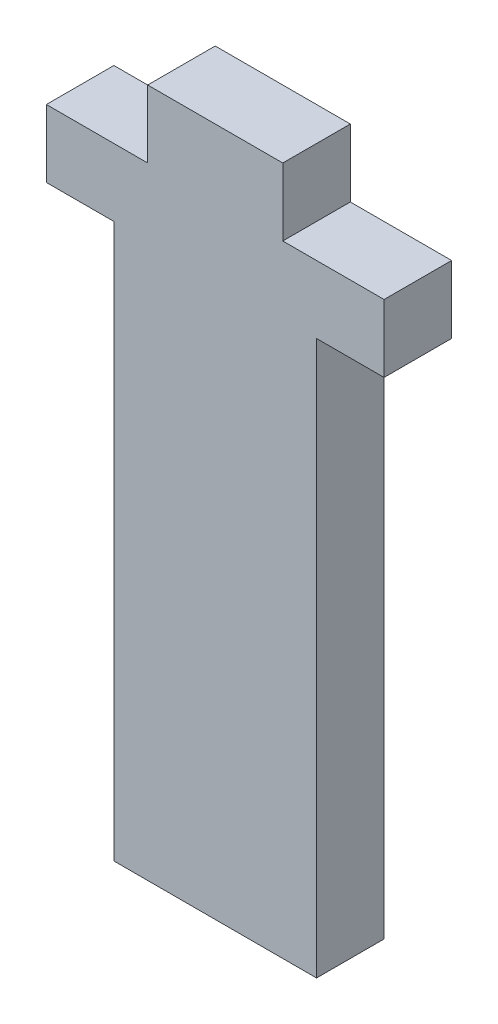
ISO-10303-21;
HEADER;
FILE_DESCRIPTION(('STEP AP214'),'2;1');
FILE_NAME('part.step','',(''),(''),'','','');
FILE_SCHEMA(('AUTOMOTIVE_DESIGN { 1 0 10303 214 1 1 1 1 }'));
ENDSEC;
DATA;
#1=APPLICATION_CONTEXT('core data for automotive mechanical design processes');
#2=APPLICATION_PROTOCOL_DEFINITION('international standard','automotive_design',2000,#1);
#3=PRODUCT_CONTEXT('',#1,'mechanical');
#4=PRODUCT('Part','Part','',(#3));
#5=PRODUCT_RELATED_PRODUCT_CATEGORY('part','',(#4));
#6=PRODUCT_DEFINITION_FORMATION('','',#4);
#7=PRODUCT_DEFINITION_CONTEXT('part definition',#1,'design');
#8=PRODUCT_DEFINITION('design','',#6,#7);
#9=PRODUCT_DEFINITION_SHAPE('','',#8);
#10=(LENGTH_UNIT() NAMED_UNIT(*) SI_UNIT(.MILLI.,.METRE.));
#11=(NAMED_UNIT(*) PLANE_ANGLE_UNIT() SI_UNIT($,.RADIAN.));
#12=(NAMED_UNIT(*) SI_UNIT($,.STERADIAN.) SOLID_ANGLE_UNIT());
#13=UNCERTAINTY_MEASURE_WITH_UNIT(LENGTH_MEASURE(1.E-05),#10,'distance_accuracy_value','');
#14=(GEOMETRIC_REPRESENTATION_CONTEXT(3) GLOBAL_UNCERTAINTY_ASSIGNED_CONTEXT((#13)) GLOBAL_UNIT_ASSIGNED_CONTEXT((#10,
#11,#12)) REPRESENTATION_CONTEXT('',''));
#15=CARTESIAN_POINT('',(0.,0.,0.));
#16=DIRECTION('',(0.,0.,1.));
#17=DIRECTION('',(1.,0.,0.));
#18=AXIS2_PLACEMENT_3D('',#15,#16,#17);
#19=CARTESIAN_POINT('',(12.5,25.5,5.));
#20=DIRECTION('',(-1.,0.,0.));
#21=DIRECTION('',(0.,-1.,0.));
#22=AXIS2_PLACEMENT_3D('',#19,#20,#21);
#23=PLANE('',#22);
#24=DIRECTION('',(0.,1.,0.));
#25=VECTOR('',#24,1.);
#26=CARTESIAN_POINT('',(12.5,25.5,5.));
#27=LINE('',#26,#25);
#28=CARTESIAN_POINT('',(12.5,15.5,5.));
#29=VERTEX_POINT('',#28);
#30=CARTESIAN_POINT('',(12.5,20.5,5.));
#31=VERTEX_POINT('',#30);
#32=EDGE_CURVE('E193',#29,#31,#27,.T.);
#33=ORIENTED_EDGE('',*,*,#32,.F.);
#34=DIRECTION('',(0.,0.,1.));
#35=VECTOR('',#34,1.);
#36=CARTESIAN_POINT('',(12.5,15.5,-0.00100000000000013));
#37=LINE('',#36,#35);
#38=CARTESIAN_POINT('',(12.5,15.5,0.));
#39=VERTEX_POINT('',#38);
#40=EDGE_CURVE('E151',#39,#29,#37,.T.);
#41=ORIENTED_EDGE('',*,*,#40,.F.);
#42=DIRECTION('',(0.,1.,0.));
#43=VECTOR('',#42,1.);
#44=CARTESIAN_POINT('',(12.5,25.5,0.));
#45=LINE('',#44,#43);
#46=CARTESIAN_POINT('',(12.5,20.5,0.));
#47=VERTEX_POINT('',#46);
#48=EDGE_CURVE('E175',#39,#47,#45,.T.);
#49=ORIENTED_EDGE('',*,*,#48,.T.);
#50=DIRECTION('',(0.,0.,1.));
#51=VECTOR('',#50,1.);
#52=CARTESIAN_POINT('',(12.5,20.5,-0.00100000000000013));
#53=LINE('',#52,#51);
#54=EDGE_CURVE('E161',#47,#31,#53,.T.);
#55=ORIENTED_EDGE('',*,*,#54,.T.);
#56=EDGE_LOOP('',(#33,#41,#49,#55));
#57=FACE_BOUND('',#56,.T.);
#58=ADVANCED_FACE('F35',(#57),#23,.F.);
#59=CARTESIAN_POINT('',(-12.5,25.5,5.));
#60=DIRECTION('',(0.,-1.,0.));
#61=DIRECTION('',(0.,0.,-1.));
#62=AXIS2_PLACEMENT_3D('',#59,#60,#61);
#63=PLANE('',#62);
#64=DIRECTION('',(-1.,0.,0.));
#65=VECTOR('',#64,1.);
#66=CARTESIAN_POINT('',(-12.5,25.5,0.));
#67=LINE('',#66,#65);
#68=CARTESIAN_POINT('',(4.99999999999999,25.5,0.));
#69=VERTEX_POINT('',#68);
#70=CARTESIAN_POINT('',(-5.00000000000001,25.5,0.));
#71=VERTEX_POINT('',#70);
#72=EDGE_CURVE('E200',#69,#71,#67,.T.);
#73=ORIENTED_EDGE('',*,*,#72,.T.);
#74=DIRECTION('',(0.,0.,1.));
#75=VECTOR('',#74,1.);
#76=CARTESIAN_POINT('',(-5.00000000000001,25.5,-0.00100000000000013));
#77=LINE('',#76,#75);
#78=CARTESIAN_POINT('',(-5.00000000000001,25.5,5.));
#79=VERTEX_POINT('',#78);
#80=EDGE_CURVE('E167',#71,#79,#77,.T.);
#81=ORIENTED_EDGE('',*,*,#80,.T.);
#82=DIRECTION('',(-1.,0.,0.));
#83=VECTOR('',#82,1.);
#84=CARTESIAN_POINT('',(-12.5,25.5,5.));
#85=LINE('',#84,#83);
#86=CARTESIAN_POINT('',(4.99999999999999,25.5,5.));
#87=VERTEX_POINT('',#86);
#88=EDGE_CURVE('E195',#87,#79,#85,.T.);
#89=ORIENTED_EDGE('',*,*,#88,.F.);
#90=DIRECTION('',(0.,0.,1.));
#91=VECTOR('',#90,1.);
#92=CARTESIAN_POINT('',(4.99999999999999,25.5,-0.00100000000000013));
#93=LINE('',#92,#91);
#94=EDGE_CURVE('E187',#69,#87,#93,.T.);
#95=ORIENTED_EDGE('',*,*,#94,.F.);
#96=EDGE_LOOP('',(#73,#81,#89,#95));
#97=FACE_BOUND('',#96,.T.);
#98=ADVANCED_FACE('F244',(#97),#63,.F.);
#99=CARTESIAN_POINT('',(-12.5,25.5,5.));
#100=DIRECTION('',(1.,0.,0.));
#101=DIRECTION('',(0.,1.,0.));
#102=AXIS2_PLACEMENT_3D('',#99,#100,#101);
#103=PLANE('',#102);
#104=DIRECTION('',(0.,-1.,0.));
#105=VECTOR('',#104,1.);
#106=CARTESIAN_POINT('',(-12.5,25.5,0.));
#107=LINE('',#106,#105);
#108=CARTESIAN_POINT('',(-12.5,20.5,0.));
#109=VERTEX_POINT('',#108);
#110=CARTESIAN_POINT('',(-12.5,15.5,0.));
#111=VERTEX_POINT('',#110);
#112=EDGE_CURVE('E202',#109,#111,#107,.T.);
#113=ORIENTED_EDGE('',*,*,#112,.T.);
#114=DIRECTION('',(0.,0.,1.));
#115=VECTOR('',#114,1.);
#116=CARTESIAN_POINT('',(-12.5,15.5,-0.00100000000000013));
#117=LINE('',#116,#115);
#118=CARTESIAN_POINT('',(-12.5,15.5,5.));
#119=VERTEX_POINT('',#118);
#120=EDGE_CURVE('E179',#111,#119,#117,.T.);
#121=ORIENTED_EDGE('',*,*,#120,.T.);
#122=DIRECTION('',(0.,-1.,0.));
#123=VECTOR('',#122,1.);
#124=CARTESIAN_POINT('',(-12.5,25.5,5.));
#125=LINE('',#124,#123);
#126=CARTESIAN_POINT('',(-12.5,20.5,5.));
#127=VERTEX_POINT('',#126);
#128=EDGE_CURVE('E43',#127,#119,#125,.T.);
#129=ORIENTED_EDGE('',*,*,#128,.F.);
#130=DIRECTION('',(0.,0.,1.));
#131=VECTOR('',#130,1.);
#132=CARTESIAN_POINT('',(-12.5,20.5,-0.00100000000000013));
#133=LINE('',#132,#131);
#134=EDGE_CURVE('E166',#109,#127,#133,.T.);
#135=ORIENTED_EDGE('',*,*,#134,.F.);
#136=EDGE_LOOP('',(#113,#121,#129,#135));
#137=FACE_BOUND('',#136,.T.);
#138=ADVANCED_FACE('F208',(#137),#103,.F.);
#139=CARTESIAN_POINT('',(-12.5,-25.5,5.));
#140=DIRECTION('',(0.,1.,0.));
#141=DIRECTION('',(0.,0.,1.));
#142=AXIS2_PLACEMENT_3D('',#139,#140,#141);
#143=PLANE('',#142);
#144=DIRECTION('',(1.,0.,0.));
#145=VECTOR('',#144,1.);
#146=CARTESIAN_POINT('',(-12.5,-25.5,5.));
#147=LINE('',#146,#145);
#148=CARTESIAN_POINT('',(-7.5,-25.5,5.));
#149=VERTEX_POINT('',#148);
#150=CARTESIAN_POINT('',(7.5,-25.5,5.));
#151=VERTEX_POINT('',#150);
#152=EDGE_CURVE('E11',#149,#151,#147,.T.);
#153=ORIENTED_EDGE('',*,*,#152,.F.);
#154=DIRECTION('',(0.,0.,1.));
#155=VECTOR('',#154,1.);
#156=CARTESIAN_POINT('',(-7.5,-25.5,-0.00100000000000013));
#157=LINE('',#156,#155);
#158=CARTESIAN_POINT('',(-7.5,-25.5,0.));
#159=VERTEX_POINT('',#158);
#160=EDGE_CURVE('E125',#159,#149,#157,.T.);
#161=ORIENTED_EDGE('',*,*,#160,.F.);
#162=DIRECTION('',(1.,0.,0.));
#163=VECTOR('',#162,1.);
#164=CARTESIAN_POINT('',(-12.5,-25.5,0.));
#165=LINE('',#164,#163);
#166=CARTESIAN_POINT('',(7.5,-25.5,0.));
#167=VERTEX_POINT('',#166);
#168=EDGE_CURVE('E38',#159,#167,#165,.T.);
#169=ORIENTED_EDGE('',*,*,#168,.T.);
#170=DIRECTION('',(0.,0.,1.));
#171=VECTOR('',#170,1.);
#172=CARTESIAN_POINT('',(7.5,-25.5,-0.00100000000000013));
#173=LINE('',#172,#171);
#174=EDGE_CURVE('E146',#167,#151,#173,.T.);
#175=ORIENTED_EDGE('',*,*,#174,.T.);
#176=EDGE_LOOP('',(#153,#161,#169,#175));
#177=FACE_BOUND('',#176,.T.);
#178=ADVANCED_FACE('F145',(#177),#143,.F.);
#179=CARTESIAN_POINT('',(0.,0.,5.));
#180=DIRECTION('',(0.,0.,1.));
#181=DIRECTION('',(1.,0.,0.));
#182=AXIS2_PLACEMENT_3D('',#179,#180,#181);
#183=PLANE('',#182);
#184=DIRECTION('',(-1.,0.,0.));
#185=VECTOR('',#184,1.);
#186=CARTESIAN_POINT('',(-12.5,15.5,5.));
#187=LINE('',#186,#185);
#188=CARTESIAN_POINT('',(-7.5,15.5,5.));
#189=VERTEX_POINT('',#188);
#190=EDGE_CURVE('E137',#189,#119,#187,.T.);
#191=ORIENTED_EDGE('',*,*,#190,.F.);
#192=DIRECTION('',(0.,1.,0.));
#193=VECTOR('',#192,1.);
#194=CARTESIAN_POINT('',(-7.5,15.5,5.));
#195=LINE('',#194,#193);
#196=EDGE_CURVE('E128',#149,#189,#195,.T.);
#197=ORIENTED_EDGE('',*,*,#196,.F.);
#198=ORIENTED_EDGE('',*,*,#152,.T.);
#199=DIRECTION('',(0.,-1.,0.));
#200=VECTOR('',#199,1.);
#201=CARTESIAN_POINT('',(7.5,15.5,5.));
#202=LINE('',#201,#200);
#203=CARTESIAN_POINT('',(7.5,15.5,5.));
#204=VERTEX_POINT('',#203);
#205=EDGE_CURVE('E154',#204,#151,#202,.T.);
#206=ORIENTED_EDGE('',*,*,#205,.F.);
#207=DIRECTION('',(-1.,0.,0.));
#208=VECTOR('',#207,1.);
#209=CARTESIAN_POINT('',(12.5,15.5,5.));
#210=LINE('',#209,#208);
#211=EDGE_CURVE('E220',#29,#204,#210,.T.);
#212=ORIENTED_EDGE('',*,*,#211,.F.);
#213=ORIENTED_EDGE('',*,*,#32,.T.);
#214=DIRECTION('',(1.,0.,0.));
#215=VECTOR('',#214,1.);
#216=CARTESIAN_POINT('',(12.5,20.5,5.));
#217=LINE('',#216,#215);
#218=CARTESIAN_POINT('',(4.99999999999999,20.5,5.));
#219=VERTEX_POINT('',#218);
#220=EDGE_CURVE('E184',#219,#31,#217,.T.);
#221=ORIENTED_EDGE('',*,*,#220,.F.);
#222=DIRECTION('',(0.,-1.,0.));
#223=VECTOR('',#222,1.);
#224=CARTESIAN_POINT('',(4.99999999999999,25.5,5.));
#225=LINE('',#224,#223);
#226=EDGE_CURVE('E181',#87,#219,#225,.T.);
#227=ORIENTED_EDGE('',*,*,#226,.F.);
#228=ORIENTED_EDGE('',*,*,#88,.T.);
#229=DIRECTION('',(0.,1.,0.));
#230=VECTOR('',#229,1.);
#231=CARTESIAN_POINT('',(-5.00000000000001,25.5,5.));
#232=LINE('',#231,#230);
#233=CARTESIAN_POINT('',(-5.00000000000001,20.5,5.));
#234=VERTEX_POINT('',#233);
#235=EDGE_CURVE('E164',#234,#79,#232,.T.);
#236=ORIENTED_EDGE('',*,*,#235,.F.);
#237=DIRECTION('',(1.,0.,0.));
#238=VECTOR('',#237,1.);
#239=CARTESIAN_POINT('',(-12.5,20.5,5.));
#240=LINE('',#239,#238);
#241=EDGE_CURVE('E160',#127,#234,#240,.T.);
#242=ORIENTED_EDGE('',*,*,#241,.F.);
#243=ORIENTED_EDGE('',*,*,#128,.T.);
#244=EDGE_LOOP('',(#191,#197,#198,#206,#212,#213,#221,#227,#228,#236,#242,#243));
#245=FACE_BOUND('',#244,.T.);
#246=ADVANCED_FACE('F140',(#245),#183,.T.);
#247=CARTESIAN_POINT('',(0.,0.,0.));
#248=DIRECTION('',(0.,0.,1.));
#249=DIRECTION('',(1.,0.,0.));
#250=AXIS2_PLACEMENT_3D('',#247,#248,#249);
#251=PLANE('',#250);
#252=DIRECTION('',(0.,-1.,0.));
#253=VECTOR('',#252,1.);
#254=CARTESIAN_POINT('',(-7.5,15.5,0.));
#255=LINE('',#254,#253);
#256=CARTESIAN_POINT('',(-7.5,15.5,0.));
#257=VERTEX_POINT('',#256);
#258=EDGE_CURVE('E131',#257,#159,#255,.T.);
#259=ORIENTED_EDGE('',*,*,#258,.F.);
#260=DIRECTION('',(1.,0.,0.));
#261=VECTOR('',#260,1.);
#262=CARTESIAN_POINT('',(-12.5,15.5,0.));
#263=LINE('',#262,#261);
#264=EDGE_CURVE('E51',#111,#257,#263,.T.);
#265=ORIENTED_EDGE('',*,*,#264,.F.);
#266=ORIENTED_EDGE('',*,*,#112,.F.);
#267=DIRECTION('',(-1.,0.,0.));
#268=VECTOR('',#267,1.);
#269=CARTESIAN_POINT('',(-12.5,20.5,0.));
#270=LINE('',#269,#268);
#271=CARTESIAN_POINT('',(-5.00000000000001,20.5,0.));
#272=VERTEX_POINT('',#271);
#273=EDGE_CURVE('E170',#272,#109,#270,.T.);
#274=ORIENTED_EDGE('',*,*,#273,.F.);
#275=DIRECTION('',(0.,-1.,0.));
#276=VECTOR('',#275,1.);
#277=CARTESIAN_POINT('',(-5.00000000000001,25.5,0.));
#278=LINE('',#277,#276);
#279=EDGE_CURVE('E158',#71,#272,#278,.T.);
#280=ORIENTED_EDGE('',*,*,#279,.F.);
#281=ORIENTED_EDGE('',*,*,#72,.F.);
#282=DIRECTION('',(0.,1.,0.));
#283=VECTOR('',#282,1.);
#284=CARTESIAN_POINT('',(4.99999999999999,25.5,0.));
#285=LINE('',#284,#283);
#286=CARTESIAN_POINT('',(4.99999999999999,20.5,0.));
#287=VERTEX_POINT('',#286);
#288=EDGE_CURVE('E176',#287,#69,#285,.T.);
#289=ORIENTED_EDGE('',*,*,#288,.F.);
#290=DIRECTION('',(-1.,0.,0.));
#291=VECTOR('',#290,1.);
#292=CARTESIAN_POINT('',(12.5,20.5,0.));
#293=LINE('',#292,#291);
#294=EDGE_CURVE('E178',#47,#287,#293,.T.);
#295=ORIENTED_EDGE('',*,*,#294,.F.);
#296=ORIENTED_EDGE('',*,*,#48,.F.);
#297=DIRECTION('',(1.,0.,0.));
#298=VECTOR('',#297,1.);
#299=CARTESIAN_POINT('',(12.5,15.5,0.));
#300=LINE('',#299,#298);
#301=CARTESIAN_POINT('',(7.5,15.5,0.));
#302=VERTEX_POINT('',#301);
#303=EDGE_CURVE('E147',#302,#39,#300,.T.);
#304=ORIENTED_EDGE('',*,*,#303,.F.);
#305=DIRECTION('',(0.,1.,0.));
#306=VECTOR('',#305,1.);
#307=CARTESIAN_POINT('',(7.5,15.5,0.));
#308=LINE('',#307,#306);
#309=EDGE_CURVE('E59',#167,#302,#308,.T.);
#310=ORIENTED_EDGE('',*,*,#309,.F.);
#311=ORIENTED_EDGE('',*,*,#168,.F.);
#312=EDGE_LOOP('',(#259,#265,#266,#274,#280,#281,#289,#295,#296,#304,#310,#311));
#313=FACE_BOUND('',#312,.T.);
#314=ADVANCED_FACE('F212',(#313),#251,.F.);
#315=CARTESIAN_POINT('',(12.5,20.5,-0.00100000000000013));
#316=DIRECTION('',(0.,-1.,0.));
#317=DIRECTION('',(0.,0.,-1.));
#318=AXIS2_PLACEMENT_3D('',#315,#316,#317);
#319=PLANE('',#318);
#320=ORIENTED_EDGE('',*,*,#294,.T.);
#321=DIRECTION('',(0.,0.,1.));
#322=VECTOR('',#321,1.);
#323=CARTESIAN_POINT('',(4.99999999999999,20.5,-0.00100000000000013));
#324=LINE('',#323,#322);
#325=EDGE_CURVE('E190',#287,#219,#324,.T.);
#326=ORIENTED_EDGE('',*,*,#325,.T.);
#327=ORIENTED_EDGE('',*,*,#220,.T.);
#328=ORIENTED_EDGE('',*,*,#54,.F.);
#329=EDGE_LOOP('',(#320,#326,#327,#328));
#330=FACE_BOUND('',#329,.T.);
#331=ADVANCED_FACE('F233',(#330),#319,.F.);
#332=CARTESIAN_POINT('',(4.99999999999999,25.5,-0.00100000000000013));
#333=DIRECTION('',(-1.,0.,0.));
#334=DIRECTION('',(0.,0.,1.));
#335=AXIS2_PLACEMENT_3D('',#332,#333,#334);
#336=PLANE('',#335);
#337=ORIENTED_EDGE('',*,*,#288,.T.);
#338=ORIENTED_EDGE('',*,*,#94,.T.);
#339=ORIENTED_EDGE('',*,*,#226,.T.);
#340=ORIENTED_EDGE('',*,*,#325,.F.);
#341=EDGE_LOOP('',(#337,#338,#339,#340));
#342=FACE_BOUND('',#341,.T.);
#343=ADVANCED_FACE('F240',(#342),#336,.F.);
#344=CARTESIAN_POINT('',(-5.00000000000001,25.5,-0.00100000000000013));
#345=DIRECTION('',(1.,0.,0.));
#346=DIRECTION('',(0.,0.,-1.));
#347=AXIS2_PLACEMENT_3D('',#344,#345,#346);
#348=PLANE('',#347);
#349=ORIENTED_EDGE('',*,*,#279,.T.);
#350=DIRECTION('',(0.,0.,1.));
#351=VECTOR('',#350,1.);
#352=CARTESIAN_POINT('',(-5.00000000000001,20.5,-0.00100000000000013));
#353=LINE('',#352,#351);
#354=EDGE_CURVE('E171',#272,#234,#353,.T.);
#355=ORIENTED_EDGE('',*,*,#354,.T.);
#356=ORIENTED_EDGE('',*,*,#235,.T.);
#357=ORIENTED_EDGE('',*,*,#80,.F.);
#358=EDGE_LOOP('',(#349,#355,#356,#357));
#359=FACE_BOUND('',#358,.T.);
#360=ADVANCED_FACE('F248',(#359),#348,.F.);
#361=CARTESIAN_POINT('',(-12.5,20.5,-0.00100000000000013));
#362=DIRECTION('',(0.,-1.,0.));
#363=DIRECTION('',(0.,0.,-1.));
#364=AXIS2_PLACEMENT_3D('',#361,#362,#363);
#365=PLANE('',#364);
#366=ORIENTED_EDGE('',*,*,#273,.T.);
#367=ORIENTED_EDGE('',*,*,#134,.T.);
#368=ORIENTED_EDGE('',*,*,#241,.T.);
#369=ORIENTED_EDGE('',*,*,#354,.F.);
#370=EDGE_LOOP('',(#366,#367,#368,#369));
#371=FACE_BOUND('',#370,.T.);
#372=ADVANCED_FACE('F251',(#371),#365,.F.);
#373=CARTESIAN_POINT('',(7.5,15.5,-0.00100000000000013));
#374=DIRECTION('',(-1.,0.,0.));
#375=DIRECTION('',(0.,-1.,0.));
#376=AXIS2_PLACEMENT_3D('',#373,#374,#375);
#377=PLANE('',#376);
#378=ORIENTED_EDGE('',*,*,#309,.T.);
#379=DIRECTION('',(0.,0.,1.));
#380=VECTOR('',#379,1.);
#381=CARTESIAN_POINT('',(7.5,15.5,-0.00100000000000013));
#382=LINE('',#381,#380);
#383=EDGE_CURVE('E148',#302,#204,#382,.T.);
#384=ORIENTED_EDGE('',*,*,#383,.T.);
#385=ORIENTED_EDGE('',*,*,#205,.T.);
#386=ORIENTED_EDGE('',*,*,#174,.F.);
#387=EDGE_LOOP('',(#378,#384,#385,#386));
#388=FACE_BOUND('',#387,.T.);
#389=ADVANCED_FACE('F224',(#388),#377,.F.);
#390=CARTESIAN_POINT('',(12.5,15.5,-0.00100000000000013));
#391=DIRECTION('',(0.,1.,0.));
#392=DIRECTION('',(0.,0.,1.));
#393=AXIS2_PLACEMENT_3D('',#390,#391,#392);
#394=PLANE('',#393);
#395=ORIENTED_EDGE('',*,*,#303,.T.);
#396=ORIENTED_EDGE('',*,*,#40,.T.);
#397=ORIENTED_EDGE('',*,*,#211,.T.);
#398=ORIENTED_EDGE('',*,*,#383,.F.);
#399=EDGE_LOOP('',(#395,#396,#397,#398));
#400=FACE_BOUND('',#399,.T.);
#401=ADVANCED_FACE('F258',(#400),#394,.F.);
#402=CARTESIAN_POINT('',(-12.5,15.5,-0.00100000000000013));
#403=DIRECTION('',(0.,1.,0.));
#404=DIRECTION('',(0.,0.,1.));
#405=AXIS2_PLACEMENT_3D('',#402,#403,#404);
#406=PLANE('',#405);
#407=ORIENTED_EDGE('',*,*,#264,.T.);
#408=DIRECTION('',(0.,0.,1.));
#409=VECTOR('',#408,1.);
#410=CARTESIAN_POINT('',(-7.5,15.5,-0.00100000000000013));
#411=LINE('',#410,#409);
#412=EDGE_CURVE('E136',#257,#189,#411,.T.);
#413=ORIENTED_EDGE('',*,*,#412,.T.);
#414=ORIENTED_EDGE('',*,*,#190,.T.);
#415=ORIENTED_EDGE('',*,*,#120,.F.);
#416=EDGE_LOOP('',(#407,#413,#414,#415));
#417=FACE_BOUND('',#416,.T.);
#418=ADVANCED_FACE('F337',(#417),#406,.F.);
#419=CARTESIAN_POINT('',(-7.5,15.5,-0.00100000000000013));
#420=DIRECTION('',(1.,0.,0.));
#421=DIRECTION('',(0.,1.,0.));
#422=AXIS2_PLACEMENT_3D('',#419,#420,#421);
#423=PLANE('',#422);
#424=ORIENTED_EDGE('',*,*,#258,.T.);
#425=ORIENTED_EDGE('',*,*,#160,.T.);
#426=ORIENTED_EDGE('',*,*,#196,.T.);
#427=ORIENTED_EDGE('',*,*,#412,.F.);
#428=EDGE_LOOP('',(#424,#425,#426,#427));
#429=FACE_BOUND('',#428,.T.);
#430=ADVANCED_FACE('F127',(#429),#423,.F.);
#431=CLOSED_SHELL('',(#58,#98,#138,#178,#246,#314,#331,#343,#360,#372,#389,#401,#418,#430));
#432=MANIFOLD_SOLID_BREP('B2',#431);
#433=ADVANCED_BREP_SHAPE_REPRESENTATION('',(#18,#432),#14);
#434=SHAPE_DEFINITION_REPRESENTATION(#9,#433);
ENDSEC;
END-ISO-10303-21;
